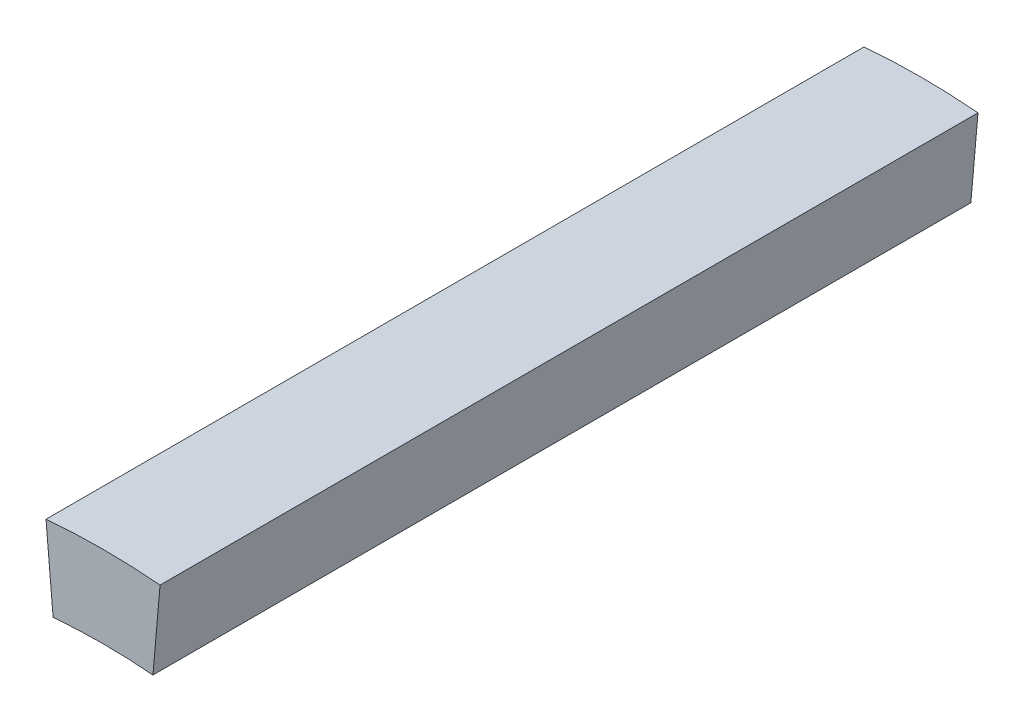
from build123d import *

# Parameters (mm, degrees)
BOSS_EXTRU_1_DEPTH = 10


with BuildPart() as part:
    # Esquisse1 → Boss.-Extru.1 (new body)
    with BuildSketch(Plane.XY):
        with BuildLine():
            Line((-0.610090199, 6.973362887), (-0.697245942, 7.969557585))
            ThreePointArc((-0.697245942, 7.969557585), (0, 8), (0.697245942, 7.969557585))
            Line((0.697245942, 7.969557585), (0.610090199, 6.973362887))
            ThreePointArc((0.610090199, 6.973362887), (0, 7), (-0.610090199, 6.973362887))
        make_face()
    extrude(amount=BOSS_EXTRU_1_DEPTH)


solid = part.part
